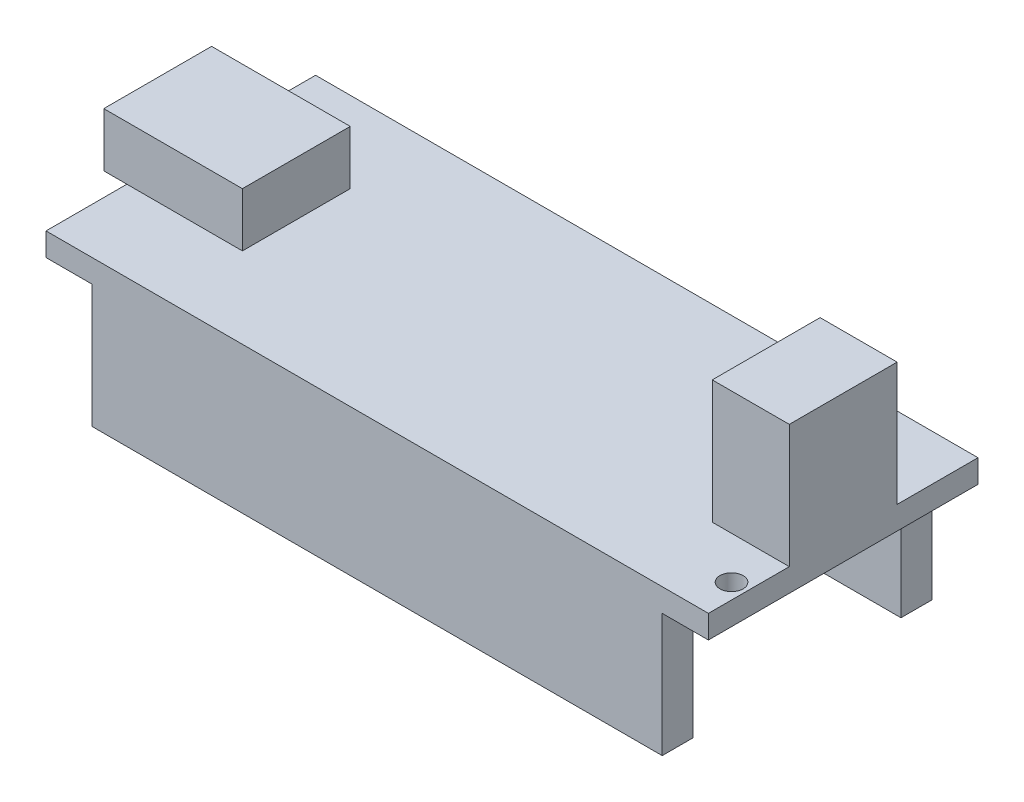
ISO-10303-21;
HEADER;
FILE_DESCRIPTION(('STEP AP214'),'2;1');
FILE_NAME('part.step','',(''),(''),'','','');
FILE_SCHEMA(('AUTOMOTIVE_DESIGN { 1 0 10303 214 1 1 1 1 }'));
ENDSEC;
DATA;
#1=APPLICATION_CONTEXT('core data for automotive mechanical design processes');
#2=APPLICATION_PROTOCOL_DEFINITION('international standard','automotive_design',2000,#1);
#3=PRODUCT_CONTEXT('',#1,'mechanical');
#4=PRODUCT('Part','Part','',(#3));
#5=PRODUCT_RELATED_PRODUCT_CATEGORY('part','',(#4));
#6=PRODUCT_DEFINITION_FORMATION('','',#4);
#7=PRODUCT_DEFINITION_CONTEXT('part definition',#1,'design');
#8=PRODUCT_DEFINITION('design','',#6,#7);
#9=PRODUCT_DEFINITION_SHAPE('','',#8);
#10=(LENGTH_UNIT() NAMED_UNIT(*) SI_UNIT(.MILLI.,.METRE.));
#11=(NAMED_UNIT(*) PLANE_ANGLE_UNIT() SI_UNIT($,.RADIAN.));
#12=(NAMED_UNIT(*) SI_UNIT($,.STERADIAN.) SOLID_ANGLE_UNIT());
#13=UNCERTAINTY_MEASURE_WITH_UNIT(LENGTH_MEASURE(1.E-05),#10,'distance_accuracy_value','');
#14=(GEOMETRIC_REPRESENTATION_CONTEXT(3) GLOBAL_UNCERTAINTY_ASSIGNED_CONTEXT((#13)) GLOBAL_UNIT_ASSIGNED_CONTEXT((#10,
#11,#12)) REPRESENTATION_CONTEXT('',''));
#15=CARTESIAN_POINT('',(0.,0.,0.));
#16=DIRECTION('',(0.,0.,1.));
#17=DIRECTION('',(1.,0.,0.));
#18=AXIS2_PLACEMENT_3D('',#15,#16,#17);
#19=CARTESIAN_POINT('',(0.,0.,0.));
#20=DIRECTION('',(0.,1.,0.));
#21=DIRECTION('',(0.,0.,1.));
#22=AXIS2_PLACEMENT_3D('',#19,#20,#21);
#23=PLANE('',#22);
#24=CARTESIAN_POINT('',(20.5,0.,6.24999999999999));
#25=DIRECTION('',(0.,1.,0.));
#26=DIRECTION('',(0.,0.,1.));
#27=AXIS2_PLACEMENT_3D('',#24,#25,#26);
#28=CIRCLE('',#27,0.750000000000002);
#29=CARTESIAN_POINT('',(20.5,0.,6.99999999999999));
#30=VERTEX_POINT('',#29);
#31=EDGE_CURVE('E292',#30,#30,#28,.T.);
#32=ORIENTED_EDGE('',*,*,#31,.T.);
#33=EDGE_LOOP('',(#32));
#34=FACE_BOUND('',#33,.T.);
#35=DIRECTION('',(0.,0.,-1.));
#36=VECTOR('',#35,1.);
#37=CARTESIAN_POINT('',(-18.5,0.,-8.75));
#38=LINE('',#37,#36);
#39=CARTESIAN_POINT('',(-18.5,0.,-6.75));
#40=VERTEX_POINT('',#39);
#41=CARTESIAN_POINT('',(-18.5,0.,-8.75));
#42=VERTEX_POINT('',#41);
#43=EDGE_CURVE('E49',#40,#42,#38,.T.);
#44=ORIENTED_EDGE('',*,*,#43,.F.);
#45=DIRECTION('',(-1.,0.,0.));
#46=VECTOR('',#45,1.);
#47=CARTESIAN_POINT('',(-18.5,0.,-6.75));
#48=LINE('',#47,#46);
#49=CARTESIAN_POINT('',(18.5,0.,-6.75));
#50=VERTEX_POINT('',#49);
#51=EDGE_CURVE('E195',#50,#40,#48,.T.);
#52=ORIENTED_EDGE('',*,*,#51,.F.);
#53=DIRECTION('',(0.,0.,1.));
#54=VECTOR('',#53,1.);
#55=CARTESIAN_POINT('',(18.5,0.,-8.75));
#56=LINE('',#55,#54);
#57=CARTESIAN_POINT('',(18.5,0.,-8.75));
#58=VERTEX_POINT('',#57);
#59=EDGE_CURVE('E533',#58,#50,#56,.T.);
#60=ORIENTED_EDGE('',*,*,#59,.F.);
#61=DIRECTION('',(-1.,0.,0.));
#62=VECTOR('',#61,1.);
#63=CARTESIAN_POINT('',(21.5,0.,-8.75000000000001));
#64=LINE('',#63,#62);
#65=CARTESIAN_POINT('',(21.5,0.,-8.75000000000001));
#66=VERTEX_POINT('',#65);
#67=EDGE_CURVE('E321',#66,#58,#64,.T.);
#68=ORIENTED_EDGE('',*,*,#67,.F.);
#69=DIRECTION('',(0.,0.,-1.));
#70=VECTOR('',#69,1.);
#71=CARTESIAN_POINT('',(21.5,0.,8.74999999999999));
#72=LINE('',#71,#70);
#73=CARTESIAN_POINT('',(21.5,0.,8.74999999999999));
#74=VERTEX_POINT('',#73);
#75=EDGE_CURVE('E318',#74,#66,#72,.T.);
#76=ORIENTED_EDGE('',*,*,#75,.F.);
#77=DIRECTION('',(1.,0.,0.));
#78=VECTOR('',#77,1.);
#79=CARTESIAN_POINT('',(21.5,0.,8.74999999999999));
#80=LINE('',#79,#78);
#81=CARTESIAN_POINT('',(18.5,0.,8.74999999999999));
#82=VERTEX_POINT('',#81);
#83=EDGE_CURVE('E314',#82,#74,#80,.T.);
#84=ORIENTED_EDGE('',*,*,#83,.F.);
#85=DIRECTION('',(0.,0.,1.));
#86=VECTOR('',#85,1.);
#87=CARTESIAN_POINT('',(18.5,0.,8.75));
#88=LINE('',#87,#86);
#89=CARTESIAN_POINT('',(18.5,0.,6.75));
#90=VERTEX_POINT('',#89);
#91=EDGE_CURVE('E210',#90,#82,#88,.T.);
#92=ORIENTED_EDGE('',*,*,#91,.F.);
#93=DIRECTION('',(1.,0.,0.));
#94=VECTOR('',#93,1.);
#95=CARTESIAN_POINT('',(-18.5,0.,6.75));
#96=LINE('',#95,#94);
#97=CARTESIAN_POINT('',(-18.5,0.,6.75));
#98=VERTEX_POINT('',#97);
#99=EDGE_CURVE('E57',#98,#90,#96,.T.);
#100=ORIENTED_EDGE('',*,*,#99,.F.);
#101=DIRECTION('',(0.,0.,-1.));
#102=VECTOR('',#101,1.);
#103=CARTESIAN_POINT('',(-18.5,0.,8.75));
#104=LINE('',#103,#102);
#105=CARTESIAN_POINT('',(-18.5,0.,8.75));
#106=VERTEX_POINT('',#105);
#107=EDGE_CURVE('E198',#106,#98,#104,.T.);
#108=ORIENTED_EDGE('',*,*,#107,.F.);
#109=CARTESIAN_POINT('',(-21.5,0.,8.75));
#110=VERTEX_POINT('',#109);
#111=EDGE_CURVE('E315',#110,#106,#80,.T.);
#112=ORIENTED_EDGE('',*,*,#111,.F.);
#113=DIRECTION('',(0.,0.,1.));
#114=VECTOR('',#113,1.);
#115=CARTESIAN_POINT('',(-21.5,0.,8.75));
#116=LINE('',#115,#114);
#117=CARTESIAN_POINT('',(-21.5,0.,-8.75));
#118=VERTEX_POINT('',#117);
#119=EDGE_CURVE('E296',#118,#110,#116,.T.);
#120=ORIENTED_EDGE('',*,*,#119,.F.);
#121=EDGE_CURVE('E320',#42,#118,#64,.T.);
#122=ORIENTED_EDGE('',*,*,#121,.F.);
#123=EDGE_LOOP('',(#44,#52,#60,#68,#76,#84,#92,#100,#108,#112,#120,#122));
#124=FACE_BOUND('',#123,.T.);
#125=ADVANCED_FACE('F32',(#34,#124),#23,.F.);
#126=CARTESIAN_POINT('',(0.,1.5,0.));
#127=DIRECTION('',(0.,1.,0.));
#128=DIRECTION('',(0.,0.,1.));
#129=AXIS2_PLACEMENT_3D('',#126,#127,#128);
#130=PLANE('',#129);
#131=CARTESIAN_POINT('',(20.5,1.5,6.24999999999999));
#132=DIRECTION('',(0.,1.,0.));
#133=DIRECTION('',(0.,0.,1.));
#134=AXIS2_PLACEMENT_3D('',#131,#132,#133);
#135=CIRCLE('',#134,0.750000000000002);
#136=CARTESIAN_POINT('',(20.5,1.5,6.99999999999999));
#137=VERTEX_POINT('',#136);
#138=EDGE_CURVE('E293',#137,#137,#135,.T.);
#139=ORIENTED_EDGE('',*,*,#138,.F.);
#140=EDGE_LOOP('',(#139));
#141=FACE_BOUND('',#140,.T.);
#142=DIRECTION('',(0.,0.,1.));
#143=VECTOR('',#142,1.);
#144=CARTESIAN_POINT('',(16.5,1.5,-3.5));
#145=LINE('',#144,#143);
#146=CARTESIAN_POINT('',(16.5,1.5,-3.5));
#147=VERTEX_POINT('',#146);
#148=CARTESIAN_POINT('',(16.5,1.5,3.5));
#149=VERTEX_POINT('',#148);
#150=EDGE_CURVE('E244',#147,#149,#145,.T.);
#151=ORIENTED_EDGE('',*,*,#150,.F.);
#152=DIRECTION('',(-1.,0.,0.));
#153=VECTOR('',#152,1.);
#154=CARTESIAN_POINT('',(21.5,1.5,-3.5));
#155=LINE('',#154,#153);
#156=CARTESIAN_POINT('',(21.5,1.5,-3.5));
#157=VERTEX_POINT('',#156);
#158=EDGE_CURVE('E230',#157,#147,#155,.T.);
#159=ORIENTED_EDGE('',*,*,#158,.F.);
#160=DIRECTION('',(0.,0.,-1.));
#161=VECTOR('',#160,1.);
#162=CARTESIAN_POINT('',(21.5,1.5,8.74999999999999));
#163=LINE('',#162,#161);
#164=CARTESIAN_POINT('',(21.5,1.5,-8.75000000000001));
#165=VERTEX_POINT('',#164);
#166=EDGE_CURVE('E306',#157,#165,#163,.T.);
#167=ORIENTED_EDGE('',*,*,#166,.T.);
#168=DIRECTION('',(-1.,0.,0.));
#169=VECTOR('',#168,1.);
#170=CARTESIAN_POINT('',(21.5,1.5,-8.75000000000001));
#171=LINE('',#170,#169);
#172=CARTESIAN_POINT('',(-21.5,1.5,-8.75));
#173=VERTEX_POINT('',#172);
#174=EDGE_CURVE('E309',#165,#173,#171,.T.);
#175=ORIENTED_EDGE('',*,*,#174,.T.);
#176=DIRECTION('',(0.,0.,1.));
#177=VECTOR('',#176,1.);
#178=CARTESIAN_POINT('',(-21.5,1.5,8.75));
#179=LINE('',#178,#177);
#180=CARTESIAN_POINT('',(-21.5,1.5,-3.5));
#181=VERTEX_POINT('',#180);
#182=EDGE_CURVE('E299',#173,#181,#179,.T.);
#183=ORIENTED_EDGE('',*,*,#182,.T.);
#184=DIRECTION('',(-1.,0.,0.));
#185=VECTOR('',#184,1.);
#186=CARTESIAN_POINT('',(-23.,1.5,-3.5));
#187=LINE('',#186,#185);
#188=CARTESIAN_POINT('',(-14.,1.5,-3.5));
#189=VERTEX_POINT('',#188);
#190=EDGE_CURVE('E265',#189,#181,#187,.T.);
#191=ORIENTED_EDGE('',*,*,#190,.F.);
#192=DIRECTION('',(0.,0.,-1.));
#193=VECTOR('',#192,1.);
#194=CARTESIAN_POINT('',(-14.,1.5,-3.5));
#195=LINE('',#194,#193);
#196=CARTESIAN_POINT('',(-14.,1.5,3.5));
#197=VERTEX_POINT('',#196);
#198=EDGE_CURVE('E275',#197,#189,#195,.T.);
#199=ORIENTED_EDGE('',*,*,#198,.F.);
#200=DIRECTION('',(1.,0.,0.));
#201=VECTOR('',#200,1.);
#202=CARTESIAN_POINT('',(-23.,1.5,3.5));
#203=LINE('',#202,#201);
#204=CARTESIAN_POINT('',(-21.5,1.5,3.5));
#205=VERTEX_POINT('',#204);
#206=EDGE_CURVE('E11',#205,#197,#203,.T.);
#207=ORIENTED_EDGE('',*,*,#206,.F.);
#208=CARTESIAN_POINT('',(-21.5,1.5,8.75));
#209=VERTEX_POINT('',#208);
#210=EDGE_CURVE('E304',#205,#209,#179,.T.);
#211=ORIENTED_EDGE('',*,*,#210,.T.);
#212=DIRECTION('',(1.,0.,0.));
#213=VECTOR('',#212,1.);
#214=CARTESIAN_POINT('',(21.5,1.5,8.74999999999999));
#215=LINE('',#214,#213);
#216=CARTESIAN_POINT('',(21.5,1.5,8.74999999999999));
#217=VERTEX_POINT('',#216);
#218=EDGE_CURVE('E302',#209,#217,#215,.T.);
#219=ORIENTED_EDGE('',*,*,#218,.T.);
#220=CARTESIAN_POINT('',(21.5,1.5,3.5));
#221=VERTEX_POINT('',#220);
#222=EDGE_CURVE('E307',#217,#221,#163,.T.);
#223=ORIENTED_EDGE('',*,*,#222,.T.);
#224=DIRECTION('',(1.,0.,0.));
#225=VECTOR('',#224,1.);
#226=CARTESIAN_POINT('',(21.5,1.5,3.5));
#227=LINE('',#226,#225);
#228=EDGE_CURVE('E235',#149,#221,#227,.T.);
#229=ORIENTED_EDGE('',*,*,#228,.F.);
#230=EDGE_LOOP('',(#151,#159,#167,#175,#183,#191,#199,#207,#211,#219,#223,#229));
#231=FACE_BOUND('',#230,.T.);
#232=ADVANCED_FACE('F368',(#141,#231),#130,.T.);
#233=CARTESIAN_POINT('',(-21.5,1.5,8.75));
#234=DIRECTION('',(1.,0.,0.));
#235=DIRECTION('',(0.,0.,-1.));
#236=AXIS2_PLACEMENT_3D('',#233,#234,#235);
#237=PLANE('',#236);
#238=ORIENTED_EDGE('',*,*,#119,.T.);
#239=DIRECTION('',(0.,-1.,0.));
#240=VECTOR('',#239,1.);
#241=CARTESIAN_POINT('',(-21.5,1.5,8.75));
#242=LINE('',#241,#240);
#243=EDGE_CURVE('E36',#209,#110,#242,.T.);
#244=ORIENTED_EDGE('',*,*,#243,.F.);
#245=ORIENTED_EDGE('',*,*,#210,.F.);
#246=EDGE_CURVE('E303',#181,#205,#179,.T.);
#247=ORIENTED_EDGE('',*,*,#246,.F.);
#248=ORIENTED_EDGE('',*,*,#182,.F.);
#249=DIRECTION('',(0.,-1.,0.));
#250=VECTOR('',#249,1.);
#251=CARTESIAN_POINT('',(-21.5,1.5,-8.75));
#252=LINE('',#251,#250);
#253=EDGE_CURVE('E311',#173,#118,#252,.T.);
#254=ORIENTED_EDGE('',*,*,#253,.T.);
#255=EDGE_LOOP('',(#238,#244,#245,#247,#248,#254));
#256=FACE_BOUND('',#255,.T.);
#257=ADVANCED_FACE('F34',(#256),#237,.F.);
#258=CARTESIAN_POINT('',(21.5,1.5,8.74999999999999));
#259=DIRECTION('',(0.,0.,-1.));
#260=DIRECTION('',(-1.,0.,0.));
#261=AXIS2_PLACEMENT_3D('',#258,#259,#260);
#262=PLANE('',#261);
#263=ORIENTED_EDGE('',*,*,#111,.T.);
#264=DIRECTION('',(0.,1.,0.));
#265=VECTOR('',#264,1.);
#266=CARTESIAN_POINT('',(-18.5,-8.,8.75));
#267=LINE('',#266,#265);
#268=CARTESIAN_POINT('',(-18.5,-8.,8.75));
#269=VERTEX_POINT('',#268);
#270=EDGE_CURVE('E215',#269,#106,#267,.T.);
#271=ORIENTED_EDGE('',*,*,#270,.F.);
#272=DIRECTION('',(-1.,0.,0.));
#273=VECTOR('',#272,1.);
#274=CARTESIAN_POINT('',(-18.5,-8.,8.75));
#275=LINE('',#274,#273);
#276=CARTESIAN_POINT('',(18.5,-8.,8.75));
#277=VERTEX_POINT('',#276);
#278=EDGE_CURVE('E214',#277,#269,#275,.T.);
#279=ORIENTED_EDGE('',*,*,#278,.F.);
#280=DIRECTION('',(0.,1.,0.));
#281=VECTOR('',#280,1.);
#282=CARTESIAN_POINT('',(18.5,-8.,8.75));
#283=LINE('',#282,#281);
#284=EDGE_CURVE('E222',#277,#82,#283,.T.);
#285=ORIENTED_EDGE('',*,*,#284,.T.);
#286=ORIENTED_EDGE('',*,*,#83,.T.);
#287=DIRECTION('',(0.,-1.,0.));
#288=VECTOR('',#287,1.);
#289=CARTESIAN_POINT('',(21.5,1.5,8.74999999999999));
#290=LINE('',#289,#288);
#291=EDGE_CURVE('E327',#217,#74,#290,.T.);
#292=ORIENTED_EDGE('',*,*,#291,.F.);
#293=ORIENTED_EDGE('',*,*,#218,.F.);
#294=ORIENTED_EDGE('',*,*,#243,.T.);
#295=EDGE_LOOP('',(#263,#271,#279,#285,#286,#292,#293,#294));
#296=FACE_BOUND('',#295,.T.);
#297=ADVANCED_FACE('F337',(#296),#262,.F.);
#298=CARTESIAN_POINT('',(21.5,1.5,8.74999999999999));
#299=DIRECTION('',(-1.,0.,0.));
#300=DIRECTION('',(0.,0.,1.));
#301=AXIS2_PLACEMENT_3D('',#298,#299,#300);
#302=PLANE('',#301);
#303=ORIENTED_EDGE('',*,*,#75,.T.);
#304=DIRECTION('',(0.,-1.,0.));
#305=VECTOR('',#304,1.);
#306=CARTESIAN_POINT('',(21.5,1.5,-8.75000000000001));
#307=LINE('',#306,#305);
#308=EDGE_CURVE('E325',#165,#66,#307,.T.);
#309=ORIENTED_EDGE('',*,*,#308,.F.);
#310=ORIENTED_EDGE('',*,*,#166,.F.);
#311=DIRECTION('',(0.,-1.,0.));
#312=VECTOR('',#311,1.);
#313=CARTESIAN_POINT('',(21.5,9.5,-3.5));
#314=LINE('',#313,#312);
#315=CARTESIAN_POINT('',(21.5,9.5,-3.5));
#316=VERTEX_POINT('',#315);
#317=EDGE_CURVE('E257',#316,#157,#314,.T.);
#318=ORIENTED_EDGE('',*,*,#317,.F.);
#319=DIRECTION('',(0.,0.,-1.));
#320=VECTOR('',#319,1.);
#321=CARTESIAN_POINT('',(21.5,9.5,-3.5));
#322=LINE('',#321,#320);
#323=CARTESIAN_POINT('',(21.5,9.5,3.5));
#324=VERTEX_POINT('',#323);
#325=EDGE_CURVE('E231',#324,#316,#322,.T.);
#326=ORIENTED_EDGE('',*,*,#325,.F.);
#327=DIRECTION('',(0.,-1.,0.));
#328=VECTOR('',#327,1.);
#329=CARTESIAN_POINT('',(21.5,9.5,3.5));
#330=LINE('',#329,#328);
#331=EDGE_CURVE('E241',#324,#221,#330,.T.);
#332=ORIENTED_EDGE('',*,*,#331,.T.);
#333=ORIENTED_EDGE('',*,*,#222,.F.);
#334=ORIENTED_EDGE('',*,*,#291,.T.);
#335=EDGE_LOOP('',(#303,#309,#310,#318,#326,#332,#333,#334));
#336=FACE_BOUND('',#335,.T.);
#337=ADVANCED_FACE('F381',(#336),#302,.F.);
#338=CARTESIAN_POINT('',(21.5,1.5,-8.75000000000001));
#339=DIRECTION('',(0.,0.,1.));
#340=DIRECTION('',(1.,0.,0.));
#341=AXIS2_PLACEMENT_3D('',#338,#339,#340);
#342=PLANE('',#341);
#343=ORIENTED_EDGE('',*,*,#67,.T.);
#344=DIRECTION('',(0.,1.,0.));
#345=VECTOR('',#344,1.);
#346=CARTESIAN_POINT('',(18.5,-8.,-8.75));
#347=LINE('',#346,#345);
#348=CARTESIAN_POINT('',(18.5,-8.,-8.75));
#349=VERTEX_POINT('',#348);
#350=EDGE_CURVE('E184',#349,#58,#347,.T.);
#351=ORIENTED_EDGE('',*,*,#350,.F.);
#352=DIRECTION('',(1.,0.,0.));
#353=VECTOR('',#352,1.);
#354=CARTESIAN_POINT('',(-18.5,-8.,-8.75));
#355=LINE('',#354,#353);
#356=CARTESIAN_POINT('',(-18.5,-8.,-8.75));
#357=VERTEX_POINT('',#356);
#358=EDGE_CURVE('E178',#357,#349,#355,.T.);
#359=ORIENTED_EDGE('',*,*,#358,.F.);
#360=DIRECTION('',(0.,1.,0.));
#361=VECTOR('',#360,1.);
#362=CARTESIAN_POINT('',(-18.5,-8.,-8.75));
#363=LINE('',#362,#361);
#364=EDGE_CURVE('E182',#357,#42,#363,.T.);
#365=ORIENTED_EDGE('',*,*,#364,.T.);
#366=ORIENTED_EDGE('',*,*,#121,.T.);
#367=ORIENTED_EDGE('',*,*,#253,.F.);
#368=ORIENTED_EDGE('',*,*,#174,.F.);
#369=ORIENTED_EDGE('',*,*,#308,.T.);
#370=EDGE_LOOP('',(#343,#351,#359,#365,#366,#367,#368,#369));
#371=FACE_BOUND('',#370,.T.);
#372=ADVANCED_FACE('F181',(#371),#342,.F.);
#373=CARTESIAN_POINT('',(20.5,1.5,6.24999999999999));
#374=DIRECTION('',(0.,-1.,0.));
#375=DIRECTION('',(0.,0.,-1.));
#376=AXIS2_PLACEMENT_3D('',#373,#374,#375);
#377=CYLINDRICAL_SURFACE('',#376,0.750000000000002);
#378=ORIENTED_EDGE('',*,*,#138,.T.);
#379=EDGE_LOOP('',(#378));
#380=FACE_BOUND('',#379,.T.);
#381=ORIENTED_EDGE('',*,*,#31,.F.);
#382=EDGE_LOOP('',(#381));
#383=FACE_BOUND('',#382,.T.);
#384=ADVANCED_FACE('F380',(#380,#383),#377,.F.);
#385=CARTESIAN_POINT('',(0.,1.5,0.));
#386=DIRECTION('',(0.,1.,0.));
#387=DIRECTION('',(0.,0.,1.));
#388=AXIS2_PLACEMENT_3D('',#385,#386,#387);
#389=PLANE('',#388);
#390=CARTESIAN_POINT('',(-23.,1.5,-3.5));
#391=VERTEX_POINT('',#390);
#392=EDGE_CURVE('E278',#181,#391,#187,.T.);
#393=ORIENTED_EDGE('',*,*,#392,.F.);
#394=ORIENTED_EDGE('',*,*,#246,.T.);
#395=CARTESIAN_POINT('',(-23.,1.5,3.5));
#396=VERTEX_POINT('',#395);
#397=EDGE_CURVE('E42',#396,#205,#203,.T.);
#398=ORIENTED_EDGE('',*,*,#397,.F.);
#399=DIRECTION('',(0.,0.,1.));
#400=VECTOR('',#399,1.);
#401=CARTESIAN_POINT('',(-23.,1.5,-3.5));
#402=LINE('',#401,#400);
#403=EDGE_CURVE('E260',#391,#396,#402,.T.);
#404=ORIENTED_EDGE('',*,*,#403,.F.);
#405=EDGE_LOOP('',(#393,#394,#398,#404));
#406=FACE_BOUND('',#405,.T.);
#407=ADVANCED_FACE('F555',(#406),#389,.F.);
#408=CARTESIAN_POINT('',(-23.,5.,-3.5));
#409=DIRECTION('',(1.,0.,0.));
#410=DIRECTION('',(0.,0.,-1.));
#411=AXIS2_PLACEMENT_3D('',#408,#409,#410);
#412=PLANE('',#411);
#413=ORIENTED_EDGE('',*,*,#403,.T.);
#414=DIRECTION('',(0.,-1.,0.));
#415=VECTOR('',#414,1.);
#416=CARTESIAN_POINT('',(-23.,5.,3.5));
#417=LINE('',#416,#415);
#418=CARTESIAN_POINT('',(-23.,5.,3.5));
#419=VERTEX_POINT('',#418);
#420=EDGE_CURVE('E289',#419,#396,#417,.T.);
#421=ORIENTED_EDGE('',*,*,#420,.F.);
#422=DIRECTION('',(0.,0.,1.));
#423=VECTOR('',#422,1.);
#424=CARTESIAN_POINT('',(-23.,5.,-3.5));
#425=LINE('',#424,#423);
#426=CARTESIAN_POINT('',(-23.,5.,-3.5));
#427=VERTEX_POINT('',#426);
#428=EDGE_CURVE('E261',#427,#419,#425,.T.);
#429=ORIENTED_EDGE('',*,*,#428,.F.);
#430=DIRECTION('',(0.,-1.,0.));
#431=VECTOR('',#430,1.);
#432=CARTESIAN_POINT('',(-23.,5.,-3.5));
#433=LINE('',#432,#431);
#434=EDGE_CURVE('E271',#427,#391,#433,.T.);
#435=ORIENTED_EDGE('',*,*,#434,.T.);
#436=EDGE_LOOP('',(#413,#421,#429,#435));
#437=FACE_BOUND('',#436,.T.);
#438=ADVANCED_FACE('F563',(#437),#412,.F.);
#439=CARTESIAN_POINT('',(-23.,5.,3.5));
#440=DIRECTION('',(0.,0.,-1.));
#441=DIRECTION('',(-1.,0.,0.));
#442=AXIS2_PLACEMENT_3D('',#439,#440,#441);
#443=PLANE('',#442);
#444=ORIENTED_EDGE('',*,*,#397,.T.);
#445=ORIENTED_EDGE('',*,*,#206,.T.);
#446=DIRECTION('',(0.,-1.,0.));
#447=VECTOR('',#446,1.);
#448=CARTESIAN_POINT('',(-14.,5.,3.5));
#449=LINE('',#448,#447);
#450=CARTESIAN_POINT('',(-14.,5.,3.5));
#451=VERTEX_POINT('',#450);
#452=EDGE_CURVE('E286',#451,#197,#449,.T.);
#453=ORIENTED_EDGE('',*,*,#452,.F.);
#454=DIRECTION('',(1.,0.,0.));
#455=VECTOR('',#454,1.);
#456=CARTESIAN_POINT('',(-23.,5.,3.5));
#457=LINE('',#456,#455);
#458=EDGE_CURVE('E264',#419,#451,#457,.T.);
#459=ORIENTED_EDGE('',*,*,#458,.F.);
#460=ORIENTED_EDGE('',*,*,#420,.T.);
#461=EDGE_LOOP('',(#444,#445,#453,#459,#460));
#462=FACE_BOUND('',#461,.T.);
#463=ADVANCED_FACE('F558',(#462),#443,.F.);
#464=CARTESIAN_POINT('',(-14.,5.,-3.5));
#465=DIRECTION('',(-1.,0.,0.));
#466=DIRECTION('',(0.,0.,1.));
#467=AXIS2_PLACEMENT_3D('',#464,#465,#466);
#468=PLANE('',#467);
#469=ORIENTED_EDGE('',*,*,#198,.T.);
#470=DIRECTION('',(0.,-1.,0.));
#471=VECTOR('',#470,1.);
#472=CARTESIAN_POINT('',(-14.,5.,-3.5));
#473=LINE('',#472,#471);
#474=CARTESIAN_POINT('',(-14.,5.,-3.5));
#475=VERTEX_POINT('',#474);
#476=EDGE_CURVE('E283',#475,#189,#473,.T.);
#477=ORIENTED_EDGE('',*,*,#476,.F.);
#478=DIRECTION('',(0.,0.,-1.));
#479=VECTOR('',#478,1.);
#480=CARTESIAN_POINT('',(-14.,5.,-3.5));
#481=LINE('',#480,#479);
#482=EDGE_CURVE('E267',#451,#475,#481,.T.);
#483=ORIENTED_EDGE('',*,*,#482,.F.);
#484=ORIENTED_EDGE('',*,*,#452,.T.);
#485=EDGE_LOOP('',(#469,#477,#483,#484));
#486=FACE_BOUND('',#485,.T.);
#487=ADVANCED_FACE('F570',(#486),#468,.F.);
#488=CARTESIAN_POINT('',(-23.,5.,-3.5));
#489=DIRECTION('',(0.,0.,1.));
#490=DIRECTION('',(1.,0.,0.));
#491=AXIS2_PLACEMENT_3D('',#488,#489,#490);
#492=PLANE('',#491);
#493=ORIENTED_EDGE('',*,*,#190,.T.);
#494=ORIENTED_EDGE('',*,*,#392,.T.);
#495=ORIENTED_EDGE('',*,*,#434,.F.);
#496=DIRECTION('',(-1.,0.,0.));
#497=VECTOR('',#496,1.);
#498=CARTESIAN_POINT('',(-23.,5.,-3.5));
#499=LINE('',#498,#497);
#500=EDGE_CURVE('E269',#475,#427,#499,.T.);
#501=ORIENTED_EDGE('',*,*,#500,.F.);
#502=ORIENTED_EDGE('',*,*,#476,.T.);
#503=EDGE_LOOP('',(#493,#494,#495,#501,#502));
#504=FACE_BOUND('',#503,.T.);
#505=ADVANCED_FACE('F567',(#504),#492,.F.);
#506=CARTESIAN_POINT('',(0.,5.,0.));
#507=DIRECTION('',(0.,1.,0.));
#508=DIRECTION('',(0.,0.,1.));
#509=AXIS2_PLACEMENT_3D('',#506,#507,#508);
#510=PLANE('',#509);
#511=ORIENTED_EDGE('',*,*,#428,.T.);
#512=ORIENTED_EDGE('',*,*,#458,.T.);
#513=ORIENTED_EDGE('',*,*,#482,.T.);
#514=ORIENTED_EDGE('',*,*,#500,.T.);
#515=EDGE_LOOP('',(#511,#512,#513,#514));
#516=FACE_BOUND('',#515,.T.);
#517=ADVANCED_FACE('F403',(#516),#510,.T.);
#518=CARTESIAN_POINT('',(21.5,9.5,-3.5));
#519=DIRECTION('',(0.,0.,1.));
#520=DIRECTION('',(1.,0.,0.));
#521=AXIS2_PLACEMENT_3D('',#518,#519,#520);
#522=PLANE('',#521);
#523=ORIENTED_EDGE('',*,*,#158,.T.);
#524=DIRECTION('',(0.,-1.,0.));
#525=VECTOR('',#524,1.);
#526=CARTESIAN_POINT('',(16.5,9.5,-3.5));
#527=LINE('',#526,#525);
#528=CARTESIAN_POINT('',(16.5,9.5,-3.5));
#529=VERTEX_POINT('',#528);
#530=EDGE_CURVE('E254',#529,#147,#527,.T.);
#531=ORIENTED_EDGE('',*,*,#530,.F.);
#532=DIRECTION('',(-1.,0.,0.));
#533=VECTOR('',#532,1.);
#534=CARTESIAN_POINT('',(21.5,9.5,-3.5));
#535=LINE('',#534,#533);
#536=EDGE_CURVE('E234',#316,#529,#535,.T.);
#537=ORIENTED_EDGE('',*,*,#536,.F.);
#538=ORIENTED_EDGE('',*,*,#317,.T.);
#539=EDGE_LOOP('',(#523,#531,#537,#538));
#540=FACE_BOUND('',#539,.T.);
#541=ADVANCED_FACE('F414',(#540),#522,.F.);
#542=CARTESIAN_POINT('',(16.5,9.5,-3.5));
#543=DIRECTION('',(1.,0.,0.));
#544=DIRECTION('',(0.,0.,-1.));
#545=AXIS2_PLACEMENT_3D('',#542,#543,#544);
#546=PLANE('',#545);
#547=ORIENTED_EDGE('',*,*,#150,.T.);
#548=DIRECTION('',(0.,-1.,0.));
#549=VECTOR('',#548,1.);
#550=CARTESIAN_POINT('',(16.5,9.5,3.5));
#551=LINE('',#550,#549);
#552=CARTESIAN_POINT('',(16.5,9.5,3.5));
#553=VERTEX_POINT('',#552);
#554=EDGE_CURVE('E251',#553,#149,#551,.T.);
#555=ORIENTED_EDGE('',*,*,#554,.F.);
#556=DIRECTION('',(0.,0.,1.));
#557=VECTOR('',#556,1.);
#558=CARTESIAN_POINT('',(16.5,9.5,-3.5));
#559=LINE('',#558,#557);
#560=EDGE_CURVE('E237',#529,#553,#559,.T.);
#561=ORIENTED_EDGE('',*,*,#560,.F.);
#562=ORIENTED_EDGE('',*,*,#530,.T.);
#563=EDGE_LOOP('',(#547,#555,#561,#562));
#564=FACE_BOUND('',#563,.T.);
#565=ADVANCED_FACE('F418',(#564),#546,.F.);
#566=CARTESIAN_POINT('',(21.5,9.5,3.5));
#567=DIRECTION('',(0.,0.,-1.));
#568=DIRECTION('',(-1.,0.,0.));
#569=AXIS2_PLACEMENT_3D('',#566,#567,#568);
#570=PLANE('',#569);
#571=ORIENTED_EDGE('',*,*,#228,.T.);
#572=ORIENTED_EDGE('',*,*,#331,.F.);
#573=DIRECTION('',(1.,0.,0.));
#574=VECTOR('',#573,1.);
#575=CARTESIAN_POINT('',(21.5,9.5,3.5));
#576=LINE('',#575,#574);
#577=EDGE_CURVE('E239',#553,#324,#576,.T.);
#578=ORIENTED_EDGE('',*,*,#577,.F.);
#579=ORIENTED_EDGE('',*,*,#554,.T.);
#580=EDGE_LOOP('',(#571,#572,#578,#579));
#581=FACE_BOUND('',#580,.T.);
#582=ADVANCED_FACE('F428',(#581),#570,.F.);
#583=CARTESIAN_POINT('',(0.,9.5,0.));
#584=DIRECTION('',(0.,-1.,0.));
#585=DIRECTION('',(0.,0.,-1.));
#586=AXIS2_PLACEMENT_3D('',#583,#584,#585);
#587=PLANE('',#586);
#588=ORIENTED_EDGE('',*,*,#325,.T.);
#589=ORIENTED_EDGE('',*,*,#536,.T.);
#590=ORIENTED_EDGE('',*,*,#560,.T.);
#591=ORIENTED_EDGE('',*,*,#577,.T.);
#592=EDGE_LOOP('',(#588,#589,#590,#591));
#593=FACE_BOUND('',#592,.T.);
#594=ADVANCED_FACE('F365',(#593),#587,.F.);
#595=CARTESIAN_POINT('',(-18.5,-8.,8.75));
#596=DIRECTION('',(1.,0.,0.));
#597=DIRECTION('',(0.,0.,-1.));
#598=AXIS2_PLACEMENT_3D('',#595,#596,#597);
#599=PLANE('',#598);
#600=ORIENTED_EDGE('',*,*,#107,.T.);
#601=DIRECTION('',(0.,1.,0.));
#602=VECTOR('',#601,1.);
#603=CARTESIAN_POINT('',(-18.5,-8.,6.75));
#604=LINE('',#603,#602);
#605=CARTESIAN_POINT('',(-18.5,-8.,6.75));
#606=VERTEX_POINT('',#605);
#607=EDGE_CURVE('E228',#606,#98,#604,.T.);
#608=ORIENTED_EDGE('',*,*,#607,.F.);
#609=DIRECTION('',(0.,0.,-1.));
#610=VECTOR('',#609,1.);
#611=CARTESIAN_POINT('',(-18.5,-8.,8.75));
#612=LINE('',#611,#610);
#613=EDGE_CURVE('E206',#269,#606,#612,.T.);
#614=ORIENTED_EDGE('',*,*,#613,.F.);
#615=ORIENTED_EDGE('',*,*,#270,.T.);
#616=EDGE_LOOP('',(#600,#608,#614,#615));
#617=FACE_BOUND('',#616,.T.);
#618=ADVANCED_FACE('F346',(#617),#599,.F.);
#619=CARTESIAN_POINT('',(-18.5,-8.,6.75));
#620=DIRECTION('',(0.,0.,1.));
#621=DIRECTION('',(1.,0.,0.));
#622=AXIS2_PLACEMENT_3D('',#619,#620,#621);
#623=PLANE('',#622);
#624=ORIENTED_EDGE('',*,*,#99,.T.);
#625=DIRECTION('',(0.,1.,0.));
#626=VECTOR('',#625,1.);
#627=CARTESIAN_POINT('',(18.5,-8.,6.75));
#628=LINE('',#627,#626);
#629=CARTESIAN_POINT('',(18.5,-8.,6.75));
#630=VERTEX_POINT('',#629);
#631=EDGE_CURVE('E225',#630,#90,#628,.T.);
#632=ORIENTED_EDGE('',*,*,#631,.F.);
#633=DIRECTION('',(1.,0.,0.));
#634=VECTOR('',#633,1.);
#635=CARTESIAN_POINT('',(-18.5,-8.,6.75));
#636=LINE('',#635,#634);
#637=EDGE_CURVE('E209',#606,#630,#636,.T.);
#638=ORIENTED_EDGE('',*,*,#637,.F.);
#639=ORIENTED_EDGE('',*,*,#607,.T.);
#640=EDGE_LOOP('',(#624,#632,#638,#639));
#641=FACE_BOUND('',#640,.T.);
#642=ADVANCED_FACE('F357',(#641),#623,.F.);
#643=CARTESIAN_POINT('',(18.5,-8.,8.75));
#644=DIRECTION('',(-1.,0.,0.));
#645=DIRECTION('',(0.,0.,1.));
#646=AXIS2_PLACEMENT_3D('',#643,#644,#645);
#647=PLANE('',#646);
#648=ORIENTED_EDGE('',*,*,#91,.T.);
#649=ORIENTED_EDGE('',*,*,#284,.F.);
#650=DIRECTION('',(0.,0.,1.));
#651=VECTOR('',#650,1.);
#652=CARTESIAN_POINT('',(18.5,-8.,8.75));
#653=LINE('',#652,#651);
#654=EDGE_CURVE('E212',#630,#277,#653,.T.);
#655=ORIENTED_EDGE('',*,*,#654,.F.);
#656=ORIENTED_EDGE('',*,*,#631,.T.);
#657=EDGE_LOOP('',(#648,#649,#655,#656));
#658=FACE_BOUND('',#657,.T.);
#659=ADVANCED_FACE('F355',(#658),#647,.F.);
#660=CARTESIAN_POINT('',(0.,-8.,0.));
#661=DIRECTION('',(0.,-1.,0.));
#662=DIRECTION('',(0.,0.,-1.));
#663=AXIS2_PLACEMENT_3D('',#660,#661,#662);
#664=PLANE('',#663);
#665=ORIENTED_EDGE('',*,*,#613,.T.);
#666=ORIENTED_EDGE('',*,*,#637,.T.);
#667=ORIENTED_EDGE('',*,*,#654,.T.);
#668=ORIENTED_EDGE('',*,*,#278,.T.);
#669=EDGE_LOOP('',(#665,#666,#667,#668));
#670=FACE_BOUND('',#669,.T.);
#671=ADVANCED_FACE('F351',(#670),#664,.T.);
#672=CARTESIAN_POINT('',(-18.5,-8.,-8.75));
#673=DIRECTION('',(1.,0.,0.));
#674=DIRECTION('',(0.,0.,-1.));
#675=AXIS2_PLACEMENT_3D('',#672,#673,#674);
#676=PLANE('',#675);
#677=ORIENTED_EDGE('',*,*,#43,.T.);
#678=ORIENTED_EDGE('',*,*,#364,.F.);
#679=DIRECTION('',(0.,0.,-1.));
#680=VECTOR('',#679,1.);
#681=CARTESIAN_POINT('',(-18.5,-8.,-8.75));
#682=LINE('',#681,#680);
#683=CARTESIAN_POINT('',(-18.5,-8.,-6.75));
#684=VERTEX_POINT('',#683);
#685=EDGE_CURVE('E188',#684,#357,#682,.T.);
#686=ORIENTED_EDGE('',*,*,#685,.F.);
#687=DIRECTION('',(0.,1.,0.));
#688=VECTOR('',#687,1.);
#689=CARTESIAN_POINT('',(-18.5,-8.,-6.75));
#690=LINE('',#689,#688);
#691=EDGE_CURVE('E530',#684,#40,#690,.T.);
#692=ORIENTED_EDGE('',*,*,#691,.T.);
#693=EDGE_LOOP('',(#677,#678,#686,#692));
#694=FACE_BOUND('',#693,.T.);
#695=ADVANCED_FACE('F197',(#694),#676,.F.);
#696=CARTESIAN_POINT('',(18.5,-8.,-8.75));
#697=DIRECTION('',(-1.,0.,0.));
#698=DIRECTION('',(0.,0.,1.));
#699=AXIS2_PLACEMENT_3D('',#696,#697,#698);
#700=PLANE('',#699);
#701=ORIENTED_EDGE('',*,*,#59,.T.);
#702=DIRECTION('',(0.,1.,0.));
#703=VECTOR('',#702,1.);
#704=CARTESIAN_POINT('',(18.5,-8.,-6.75));
#705=LINE('',#704,#703);
#706=CARTESIAN_POINT('',(18.5,-8.,-6.75));
#707=VERTEX_POINT('',#706);
#708=EDGE_CURVE('E202',#707,#50,#705,.T.);
#709=ORIENTED_EDGE('',*,*,#708,.F.);
#710=DIRECTION('',(0.,0.,1.));
#711=VECTOR('',#710,1.);
#712=CARTESIAN_POINT('',(18.5,-8.,-8.75));
#713=LINE('',#712,#711);
#714=EDGE_CURVE('E187',#349,#707,#713,.T.);
#715=ORIENTED_EDGE('',*,*,#714,.F.);
#716=ORIENTED_EDGE('',*,*,#350,.T.);
#717=EDGE_LOOP('',(#701,#709,#715,#716));
#718=FACE_BOUND('',#717,.T.);
#719=ADVANCED_FACE('F497',(#718),#700,.F.);
#720=CARTESIAN_POINT('',(-18.5,-8.,-6.75));
#721=DIRECTION('',(0.,0.,-1.));
#722=DIRECTION('',(-1.,0.,0.));
#723=AXIS2_PLACEMENT_3D('',#720,#721,#722);
#724=PLANE('',#723);
#725=ORIENTED_EDGE('',*,*,#51,.T.);
#726=ORIENTED_EDGE('',*,*,#691,.F.);
#727=DIRECTION('',(-1.,0.,0.));
#728=VECTOR('',#727,1.);
#729=CARTESIAN_POINT('',(-18.5,-8.,-6.75));
#730=LINE('',#729,#728);
#731=EDGE_CURVE('E193',#707,#684,#730,.T.);
#732=ORIENTED_EDGE('',*,*,#731,.F.);
#733=ORIENTED_EDGE('',*,*,#708,.T.);
#734=EDGE_LOOP('',(#725,#726,#732,#733));
#735=FACE_BOUND('',#734,.T.);
#736=ADVANCED_FACE('F506',(#735),#724,.F.);
#737=CARTESIAN_POINT('',(0.,-8.,0.));
#738=DIRECTION('',(0.,1.,0.));
#739=DIRECTION('',(0.,0.,1.));
#740=AXIS2_PLACEMENT_3D('',#737,#738,#739);
#741=PLANE('',#740);
#742=ORIENTED_EDGE('',*,*,#685,.T.);
#743=ORIENTED_EDGE('',*,*,#358,.T.);
#744=ORIENTED_EDGE('',*,*,#714,.T.);
#745=ORIENTED_EDGE('',*,*,#731,.T.);
#746=EDGE_LOOP('',(#742,#743,#744,#745));
#747=FACE_BOUND('',#746,.T.);
#748=ADVANCED_FACE('F191',(#747),#741,.F.);
#749=CLOSED_SHELL('',(#125,#232,#257,#297,#337,#372,#384,#407,#438,#463,#487,#505,#517,#541,
#565,#582,#594,#618,#642,#659,#671,#695,#719,#736,#748));
#750=MANIFOLD_SOLID_BREP('B2',#749);
#751=ADVANCED_BREP_SHAPE_REPRESENTATION('',(#18,#750),#14);
#752=SHAPE_DEFINITION_REPRESENTATION(#9,#751);
ENDSEC;
END-ISO-10303-21;
